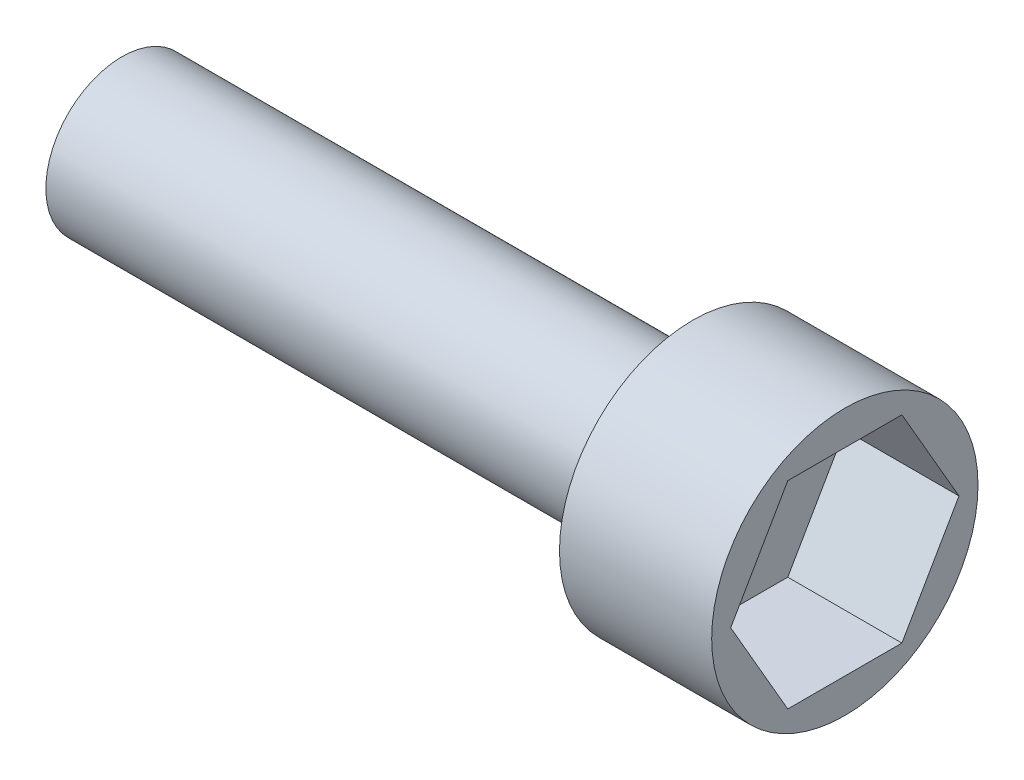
from build123d import *

# Parameters (mm, degrees)
SKETCH1_R           = 2
BOSS_EXTRUDE1_DEPTH = 15
SKETCH2_R           = 3.5
BOSS_EXTRUDE2_DEPTH = 4
CUT_EXTRUDE1_DEPTH  = 3


with BuildPart() as part:
    # Sketch1 → Boss-Extrude1 (new body)
    with BuildSketch(Plane(origin=(0, 0, 0), x_dir=(0, 0, -1), z_dir=(1, 0, 0))):
        Circle(SKETCH1_R)
    extrude(amount=BOSS_EXTRUDE1_DEPTH)

    # Sketch2 → Boss-Extrude2 (add)
    with BuildSketch(Plane(origin=(15, 0, 0), x_dir=(0, 0, -1), z_dir=(1, 0, 0))):
        Circle(SKETCH2_R)
    extrude(amount=BOSS_EXTRUDE2_DEPTH)

    # Sketch3 → Cut-Extrude1 (cut)
    with BuildSketch(Plane(origin=(19, 0, 0), x_dir=(0, 0, -1), z_dir=(1, 0, 0))):
        Polygon((-3, 0), (-1.5, -2.598076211), (1.5, -2.598076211), (3, 0), (1.5, 2.598076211), (-1.5, 2.598076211), align=None)
    extrude(amount=-CUT_EXTRUDE1_DEPTH, mode=Mode.SUBTRACT)


solid = part.part
